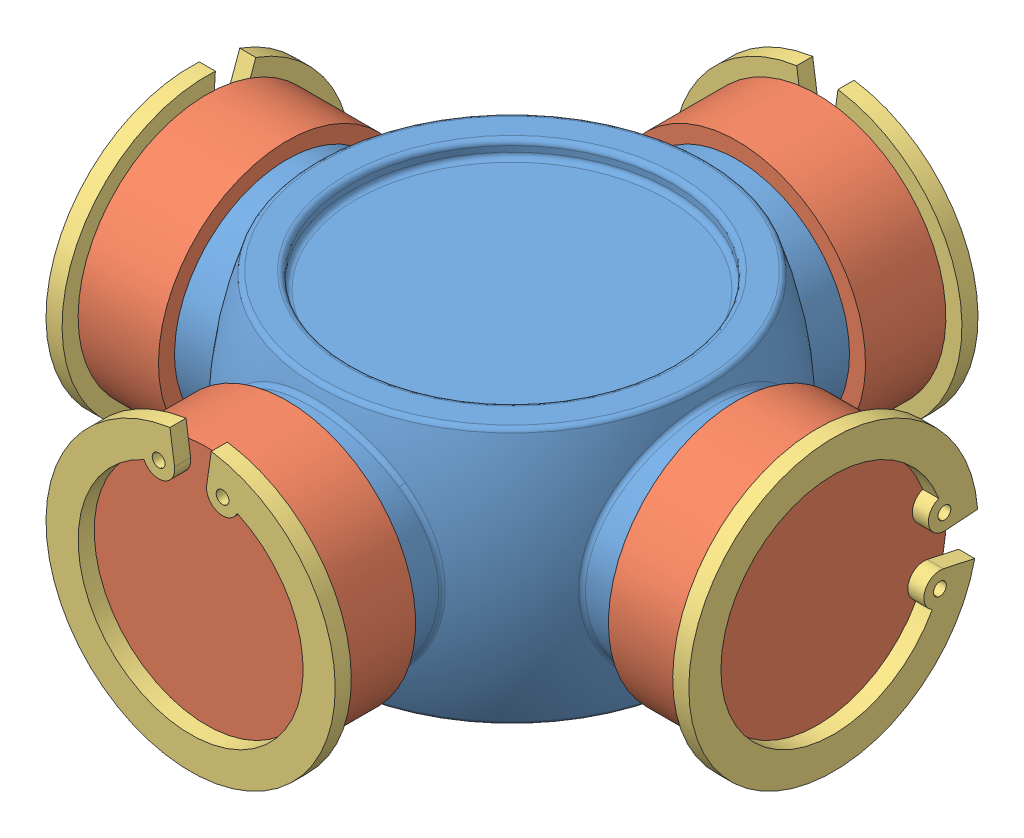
SolidWorks assembly joint_croix.SLDASM, configuration Défaut (file format 4400). Lengths in mm.
Overall size (31.75 17.28 31.75).
9 component instances, 3 part files, 16 mates.
Components (placement in the parent):
- croix-1: croix.sldprt [Défaut] at origin size (28.57 12.7 28.57)
- coussinet-1: coussinet.sldprt [Défaut] at (-8.501 0 0) x (0 0.97948 0.20154) z (-1 0 0) size (12.7 12.7 3.97)
- coussinet-2: coussinet.sldprt [Défaut] at (-0.0002 0 -8.5008) x (0.94577 -0.324837 0) z (0 0 -1) size (12.7 12.7 3.97)
- coussinet-3: coussinet.sldprt [Défaut] at (-0.0002 0 8.5008) size (12.7 12.7 3.97)
- coussinet-4: coussinet.sldprt [Défaut] at (8.5006 0 0) x (0 -0.488169 -0.872749) z (1 0 0) size (12.7 12.7 3.97)
- snapring-1: snapring.sldprt [Défaut] at (15.4779 -0.0149 -0.2115) x (0 -0.997523 0.070347) z (1 0 0) size (14.29 14.21 0.79)
- snapring-2: snapring.sldprt [Défaut] at (-0.0002 0.212 -15.4781) size (14.29 14.21 0.79)
- snapring-3: snapring.sldprt [Défaut] at (-0.0002 0.212 15.4781) size (14.29 14.21 0.79)
- snapring-4: snapring.sldprt [Défaut] at (-15.4783 0.2076 -0.0428) x (0 -0.201908 -0.979404) z (1 0 0) size (14.29 14.21 0.79)
Mates (geometry in assembly coordinates):
- Coïncidente1: coincident: plane of croix-1 through (-0.0002 0 14.2875) normal (0 0 1); plane of coussinet-3 through (-0.0002 0 14.2875) normal (0 0 -1)
- Coaxiale1: concentric anti-aligned: cylinder of croix-1 through (-0.0002 0 6.35) axis (0 0 1) radius 5.5563; cylinder of coussinet-3 through (-0.0002 0 14.2875) axis (0 0 -1) radius 6.35
- Coïncidente2: coincident: plane of coussinet-3 through (-0.0002 0 15.0813) normal (0 0 1); plane of snapring-3 through (-0.0002 0 15.0813) normal (0 0 -1)
- Coaxiale2: concentric aligned: cylinder of coussinet-3 through (-0.0002 0 14.2875) axis (0 0 -1) radius 6.35; cylinder of snapring-3 through (-0.0002 0 15.875) axis (0 0 -1) radius 5.5563
- Coïncidente3: coincident: plane of croix-1 through (-14.2877 0 0) normal (-1 0 0); plane of coussinet-1
- Coaxiale3: concentric anti-aligned: cylinder of croix-1 through (-6.3502 0 0) axis (-1 0 0) radius 5.5563; cylinder of coussinet-1 through (-14.2877 0 0) axis (1 0 0) radius 6.35
- Coïncidente4: coincident: plane of croix-1 through (-0.0002 0 -14.2875) normal (0 0 -1); plane of coussinet-2 through (-0.0002 0 -14.2875) normal (0 0 1)
- Coaxiale4: concentric anti-aligned: cylinder of croix-1 through (-0.0002 0 -6.35) axis (0 0 -1) radius 5.5563; cylinder of coussinet-2 through (-0.0002 0 -14.2875) axis (0 0 1) radius 6.35
- Coïncidente5: coincident: plane of coussinet-2 through (-0.0002 0 -15.0812) normal (0 0 -1); plane of snapring-2 through (-0.0002 0 -15.0812) normal (0 0 1)
- Coaxiale5: concentric anti-aligned: cylinder of coussinet-2 through (-0.0002 0 -14.2875) axis (0 0 1) radius 6.35; cylinder of snapring-2 through (-0.0002 0 -15.0812) axis (0 0 -1) radius 5.5563
- Coïncidente6: coincident: plane of coussinet-1; plane of snapring-4
- Coaxiale6: concentric anti-aligned: cylinder of coussinet-1 through (-14.2877 0 0) axis (1 0 0) radius 6.35; cylinder of snapring-4 through (-15.0815 0 0) axis (-1 0 0) radius 5.5563
- Coïncidente7: coincident: plane of croix-1 through (14.2873 0 0) normal (1 0 0); plane of coussinet-4
- Coaxiale7: concentric anti-aligned: cylinder of croix-1 through (6.3498 0 0) axis (1 0 0) radius 5.5563; cylinder of coussinet-4 through (14.2873 0 0) axis (-1 0 0) radius 6.35
- Coïncidente8: coincident: plane of coussinet-4; plane of snapring-1
- Coaxiale8: concentric aligned: cylinder of coussinet-4 through (14.2873 0 0) axis (-1 0 0) radius 6.35; cylinder of snapring-1 through (15.8748 14.7099 6.3617) axis (-1 0 0) radius 5.5563
